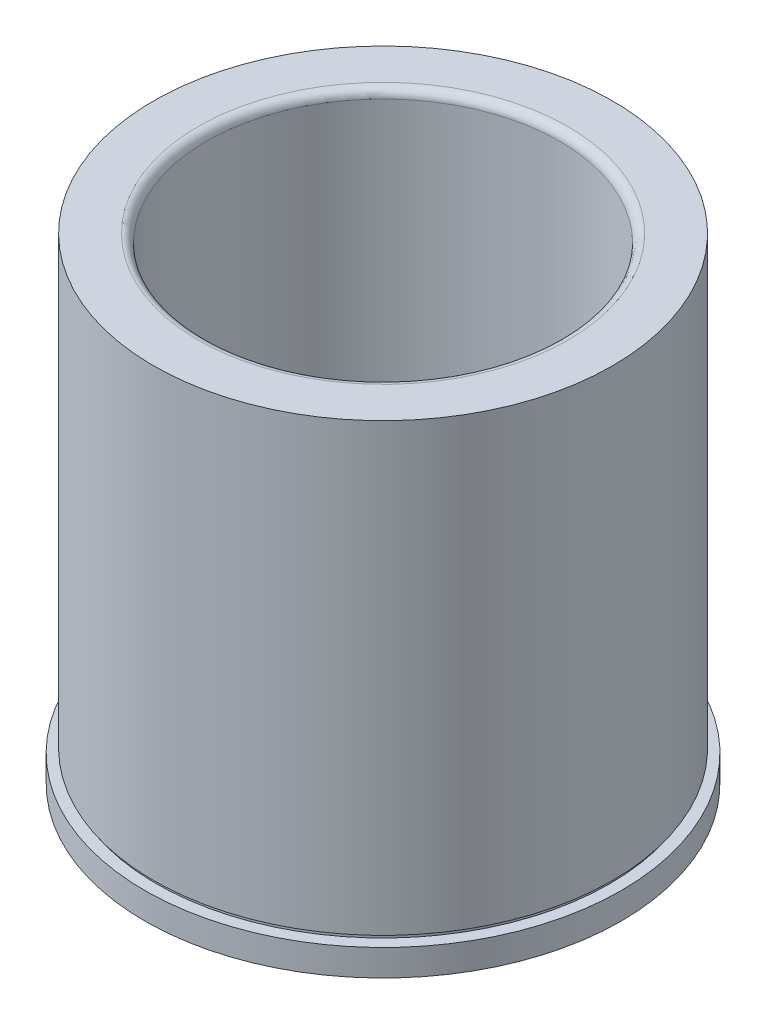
ISO-10303-21;
HEADER;
FILE_DESCRIPTION(('STEP AP214'),'2;1');
FILE_NAME('part.step','',(''),(''),'','','');
FILE_SCHEMA(('AUTOMOTIVE_DESIGN { 1 0 10303 214 1 1 1 1 }'));
ENDSEC;
DATA;
#1=APPLICATION_CONTEXT('core data for automotive mechanical design processes');
#2=APPLICATION_PROTOCOL_DEFINITION('international standard','automotive_design',2000,#1);
#3=PRODUCT_CONTEXT('',#1,'mechanical');
#4=PRODUCT('Part','Part','',(#3));
#5=PRODUCT_RELATED_PRODUCT_CATEGORY('part','',(#4));
#6=PRODUCT_DEFINITION_FORMATION('','',#4);
#7=PRODUCT_DEFINITION_CONTEXT('part definition',#1,'design');
#8=PRODUCT_DEFINITION('design','',#6,#7);
#9=PRODUCT_DEFINITION_SHAPE('','',#8);
#10=(LENGTH_UNIT() NAMED_UNIT(*) SI_UNIT(.MILLI.,.METRE.));
#11=(NAMED_UNIT(*) PLANE_ANGLE_UNIT() SI_UNIT($,.RADIAN.));
#12=(NAMED_UNIT(*) SI_UNIT($,.STERADIAN.) SOLID_ANGLE_UNIT());
#13=UNCERTAINTY_MEASURE_WITH_UNIT(LENGTH_MEASURE(1.E-05),#10,'distance_accuracy_value','');
#14=(GEOMETRIC_REPRESENTATION_CONTEXT(3) GLOBAL_UNCERTAINTY_ASSIGNED_CONTEXT((#13)) GLOBAL_UNIT_ASSIGNED_CONTEXT((#10,
#11,#12)) REPRESENTATION_CONTEXT('',''));
#15=CARTESIAN_POINT('',(0.,0.,0.));
#16=DIRECTION('',(0.,0.,1.));
#17=DIRECTION('',(1.,0.,0.));
#18=AXIS2_PLACEMENT_3D('',#15,#16,#17);
#19=CARTESIAN_POINT('',(-41.28135,101.650690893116,0.));
#20=DIRECTION('',(0.,-1.,0.));
#21=DIRECTION('',(1.,0.,0.));
#22=AXIS2_PLACEMENT_3D('',#19,#20,#21);
#23=PLANE('',#22);
#24=CARTESIAN_POINT('',(-3.54911695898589E-13,101.650690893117,0.));
#25=DIRECTION('',(0.,-1.,0.));
#26=DIRECTION('',(1.,0.,0.));
#27=AXIS2_PLACEMENT_3D('',#24,#25,#26);
#28=CIRCLE('',#27,33.2803499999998);
#29=CARTESIAN_POINT('',(33.2803499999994,101.650690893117,0.));
#30=VERTEX_POINT('',#29);
#31=EDGE_CURVE('E35',#30,#30,#28,.T.);
#32=ORIENTED_EDGE('',*,*,#31,.T.);
#33=EDGE_LOOP('',(#32));
#34=FACE_BOUND('',#33,.T.);
#35=CARTESIAN_POINT('',(-3.5491169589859E-13,101.650690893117,0.));
#36=DIRECTION('',(0.,-1.,0.));
#37=DIRECTION('',(1.,0.,0.));
#38=AXIS2_PLACEMENT_3D('',#35,#36,#37);
#39=CIRCLE('',#38,41.2813499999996);
#40=CARTESIAN_POINT('',(41.2813499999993,101.650690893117,0.));
#41=VERTEX_POINT('',#40);
#42=EDGE_CURVE('E63',#41,#41,#39,.T.);
#43=ORIENTED_EDGE('',*,*,#42,.F.);
#44=EDGE_LOOP('',(#43));
#45=FACE_BOUND('',#44,.T.);
#46=ADVANCED_FACE('F28',(#34,#45),#23,.F.);
#47=CARTESIAN_POINT('',(3.49148336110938E-12,-1000.,0.));
#48=DIRECTION('',(0.,-1.,0.));
#49=DIRECTION('',(1.,0.,0.));
#50=AXIS2_PLACEMENT_3D('',#47,#48,#49);
#51=CYLINDRICAL_SURFACE('',#50,31.7563499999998);
#52=CARTESIAN_POINT('',(-3.4959067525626E-13,100.126690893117,0.));
#53=DIRECTION('',(0.,-1.,0.));
#54=DIRECTION('',(1.,0.,0.));
#55=AXIS2_PLACEMENT_3D('',#52,#53,#54);
#56=CIRCLE('',#55,31.7563499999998);
#57=CARTESIAN_POINT('',(31.7563499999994,100.126690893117,0.));
#58=VERTEX_POINT('',#57);
#59=EDGE_CURVE('E10',#58,#58,#56,.F.);
#60=ORIENTED_EDGE('',*,*,#59,.T.);
#61=EDGE_LOOP('',(#60));
#62=FACE_BOUND('',#61,.T.);
#63=CARTESIAN_POINT('',(0.,16.7417464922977,0.));
#64=DIRECTION('',(0.,-1.,0.));
#65=DIRECTION('',(1.,0.,0.));
#66=AXIS2_PLACEMENT_3D('',#63,#64,#65);
#67=CIRCLE('',#66,31.7563499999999);
#68=CARTESIAN_POINT('',(31.7563499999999,16.7417464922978,0.));
#69=VERTEX_POINT('',#68);
#70=EDGE_CURVE('E39',#69,#69,#67,.T.);
#71=ORIENTED_EDGE('',*,*,#70,.T.);
#72=EDGE_LOOP('',(#71));
#73=FACE_BOUND('',#72,.T.);
#74=ADVANCED_FACE('F70',(#62,#73),#51,.F.);
#75=CARTESIAN_POINT('',(0.,15.9256908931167,0.));
#76=DIRECTION('',(0.,-1.,0.));
#77=DIRECTION('',(1.,0.,0.));
#78=AXIS2_PLACEMENT_3D('',#75,#76,#77);
#79=CONICAL_SURFACE('',#78,32.5724055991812,0.785398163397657);
#80=ORIENTED_EDGE('',*,*,#70,.F.);
#81=EDGE_LOOP('',(#80));
#82=FACE_BOUND('',#81,.T.);
#83=CARTESIAN_POINT('',(0.,15.9256908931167,0.));
#84=DIRECTION('',(0.,-1.,0.));
#85=DIRECTION('',(1.,0.,0.));
#86=AXIS2_PLACEMENT_3D('',#83,#84,#85);
#87=CIRCLE('',#86,32.5724055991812);
#88=CARTESIAN_POINT('',(32.5724055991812,15.9256908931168,0.));
#89=VERTEX_POINT('',#88);
#90=EDGE_CURVE('E43',#89,#89,#87,.T.);
#91=ORIENTED_EDGE('',*,*,#90,.T.);
#92=EDGE_LOOP('',(#91));
#93=FACE_BOUND('',#92,.T.);
#94=ADVANCED_FACE('F74',(#82,#93),#79,.F.);
#95=CARTESIAN_POINT('',(-32.5724055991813,15.9256908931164,0.));
#96=DIRECTION('',(0.,1.,0.));
#97=DIRECTION('',(-1.,0.,0.));
#98=AXIS2_PLACEMENT_3D('',#95,#96,#97);
#99=PLANE('',#98);
#100=ORIENTED_EDGE('',*,*,#90,.F.);
#101=EDGE_LOOP('',(#100));
#102=FACE_BOUND('',#101,.T.);
#103=CARTESIAN_POINT('',(0.,15.9256908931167,0.));
#104=DIRECTION('',(0.,-1.,0.));
#105=DIRECTION('',(1.,0.,0.));
#106=AXIS2_PLACEMENT_3D('',#103,#104,#105);
#107=CIRCLE('',#106,42.8624999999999);
#108=CARTESIAN_POINT('',(42.8624999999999,15.9256908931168,0.));
#109=VERTEX_POINT('',#108);
#110=EDGE_CURVE('E48',#109,#109,#107,.T.);
#111=ORIENTED_EDGE('',*,*,#110,.T.);
#112=EDGE_LOOP('',(#111));
#113=FACE_BOUND('',#112,.T.);
#114=ADVANCED_FACE('F79',(#102,#113),#99,.F.);
#115=CARTESIAN_POINT('',(3.49148336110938E-12,-1000.,0.));
#116=DIRECTION('',(0.,-1.,0.));
#117=DIRECTION('',(1.,0.,0.));
#118=AXIS2_PLACEMENT_3D('',#115,#116,#117);
#119=CYLINDRICAL_SURFACE('',#118,42.8624999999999);
#120=ORIENTED_EDGE('',*,*,#110,.F.);
#121=EDGE_LOOP('',(#120));
#122=FACE_BOUND('',#121,.T.);
#123=CARTESIAN_POINT('',(0.,20.6881908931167,0.));
#124=DIRECTION('',(0.,-1.,0.));
#125=DIRECTION('',(1.,0.,0.));
#126=AXIS2_PLACEMENT_3D('',#123,#124,#125);
#127=CIRCLE('',#126,42.8624999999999);
#128=CARTESIAN_POINT('',(42.8624999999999,20.6881908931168,0.));
#129=VERTEX_POINT('',#128);
#130=EDGE_CURVE('E51',#129,#129,#127,.T.);
#131=ORIENTED_EDGE('',*,*,#130,.T.);
#132=EDGE_LOOP('',(#131));
#133=FACE_BOUND('',#132,.T.);
#134=ADVANCED_FACE('F83',(#122,#133),#119,.T.);
#135=CARTESIAN_POINT('',(-42.8625,20.6881908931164,0.));
#136=DIRECTION('',(0.,-1.,0.));
#137=DIRECTION('',(1.,0.,0.));
#138=AXIS2_PLACEMENT_3D('',#135,#136,#137);
#139=PLANE('',#138);
#140=ORIENTED_EDGE('',*,*,#130,.F.);
#141=EDGE_LOOP('',(#140));
#142=FACE_BOUND('',#141,.T.);
#143=CARTESIAN_POINT('',(0.,20.6881908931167,0.));
#144=DIRECTION('',(0.,-1.,0.));
#145=DIRECTION('',(1.,0.,0.));
#146=AXIS2_PLACEMENT_3D('',#143,#144,#145);
#147=CIRCLE('',#146,40.7733499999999);
#148=CARTESIAN_POINT('',(40.7733499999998,20.6881908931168,0.));
#149=VERTEX_POINT('',#148);
#150=EDGE_CURVE('E54',#149,#149,#147,.T.);
#151=ORIENTED_EDGE('',*,*,#150,.T.);
#152=EDGE_LOOP('',(#151));
#153=FACE_BOUND('',#152,.T.);
#154=ADVANCED_FACE('F87',(#142,#153),#139,.F.);
#155=CARTESIAN_POINT('',(3.49148336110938E-12,-1000.,0.));
#156=DIRECTION('',(0.,-1.,0.));
#157=DIRECTION('',(1.,0.,0.));
#158=AXIS2_PLACEMENT_3D('',#155,#156,#157);
#159=CYLINDRICAL_SURFACE('',#158,40.7733499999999);
#160=ORIENTED_EDGE('',*,*,#150,.F.);
#161=EDGE_LOOP('',(#160));
#162=FACE_BOUND('',#161,.T.);
#163=CARTESIAN_POINT('',(0.,21.4501908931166,0.));
#164=DIRECTION('',(0.,-1.,0.));
#165=DIRECTION('',(1.,0.,0.));
#166=AXIS2_PLACEMENT_3D('',#163,#164,#165);
#167=CIRCLE('',#166,40.7733499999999);
#168=CARTESIAN_POINT('',(40.7733499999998,21.4501908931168,0.));
#169=VERTEX_POINT('',#168);
#170=EDGE_CURVE('E57',#169,#169,#167,.T.);
#171=ORIENTED_EDGE('',*,*,#170,.T.);
#172=EDGE_LOOP('',(#171));
#173=FACE_BOUND('',#172,.T.);
#174=ADVANCED_FACE('F91',(#162,#173),#159,.T.);
#175=CARTESIAN_POINT('',(-41.28135,21.4501908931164,0.));
#176=DIRECTION('',(0.,1.,0.));
#177=DIRECTION('',(-1.,0.,0.));
#178=AXIS2_PLACEMENT_3D('',#175,#176,#177);
#179=PLANE('',#178);
#180=ORIENTED_EDGE('',*,*,#170,.F.);
#181=EDGE_LOOP('',(#180));
#182=FACE_BOUND('',#181,.T.);
#183=CARTESIAN_POINT('',(0.,21.4501908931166,0.));
#184=DIRECTION('',(0.,-1.,0.));
#185=DIRECTION('',(1.,0.,0.));
#186=AXIS2_PLACEMENT_3D('',#183,#184,#185);
#187=CIRCLE('',#186,41.2813499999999);
#188=CARTESIAN_POINT('',(41.2813499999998,21.4501908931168,0.));
#189=VERTEX_POINT('',#188);
#190=EDGE_CURVE('E60',#189,#189,#187,.T.);
#191=ORIENTED_EDGE('',*,*,#190,.T.);
#192=EDGE_LOOP('',(#191));
#193=FACE_BOUND('',#192,.T.);
#194=ADVANCED_FACE('F95',(#182,#193),#179,.F.);
#195=CARTESIAN_POINT('',(3.49148336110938E-12,-1000.,0.));
#196=DIRECTION('',(0.,-1.,0.));
#197=DIRECTION('',(1.,0.,0.));
#198=AXIS2_PLACEMENT_3D('',#195,#196,#197);
#199=CYLINDRICAL_SURFACE('',#198,41.2813499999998);
#200=ORIENTED_EDGE('',*,*,#190,.F.);
#201=EDGE_LOOP('',(#200));
#202=FACE_BOUND('',#201,.T.);
#203=ORIENTED_EDGE('',*,*,#42,.T.);
#204=EDGE_LOOP('',(#203));
#205=FACE_BOUND('',#204,.T.);
#206=ADVANCED_FACE('F67',(#202,#205),#199,.T.);
#207=CARTESIAN_POINT('',(-3.49590675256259E-13,100.126690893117,0.));
#208=DIRECTION('',(0.,-1.,0.));
#209=DIRECTION('',(1.,0.,0.));
#210=AXIS2_PLACEMENT_3D('',#207,#208,#209);
#211=TOROIDAL_SURFACE('',#210,33.2803499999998,1.524);
#212=ORIENTED_EDGE('',*,*,#59,.F.);
#213=EDGE_LOOP('',(#212));
#214=FACE_BOUND('',#213,.T.);
#215=ORIENTED_EDGE('',*,*,#31,.F.);
#216=EDGE_LOOP('',(#215));
#217=FACE_BOUND('',#216,.T.);
#218=ADVANCED_FACE('F30',(#214,#217),#211,.T.);
#219=CLOSED_SHELL('',(#46,#74,#94,#114,#134,#154,#174,#194,#206,#218));
#220=MANIFOLD_SOLID_BREP('B2',#219);
#221=ADVANCED_BREP_SHAPE_REPRESENTATION('',(#18,#220),#14);
#222=SHAPE_DEFINITION_REPRESENTATION(#9,#221);
ENDSEC;
END-ISO-10303-21;
